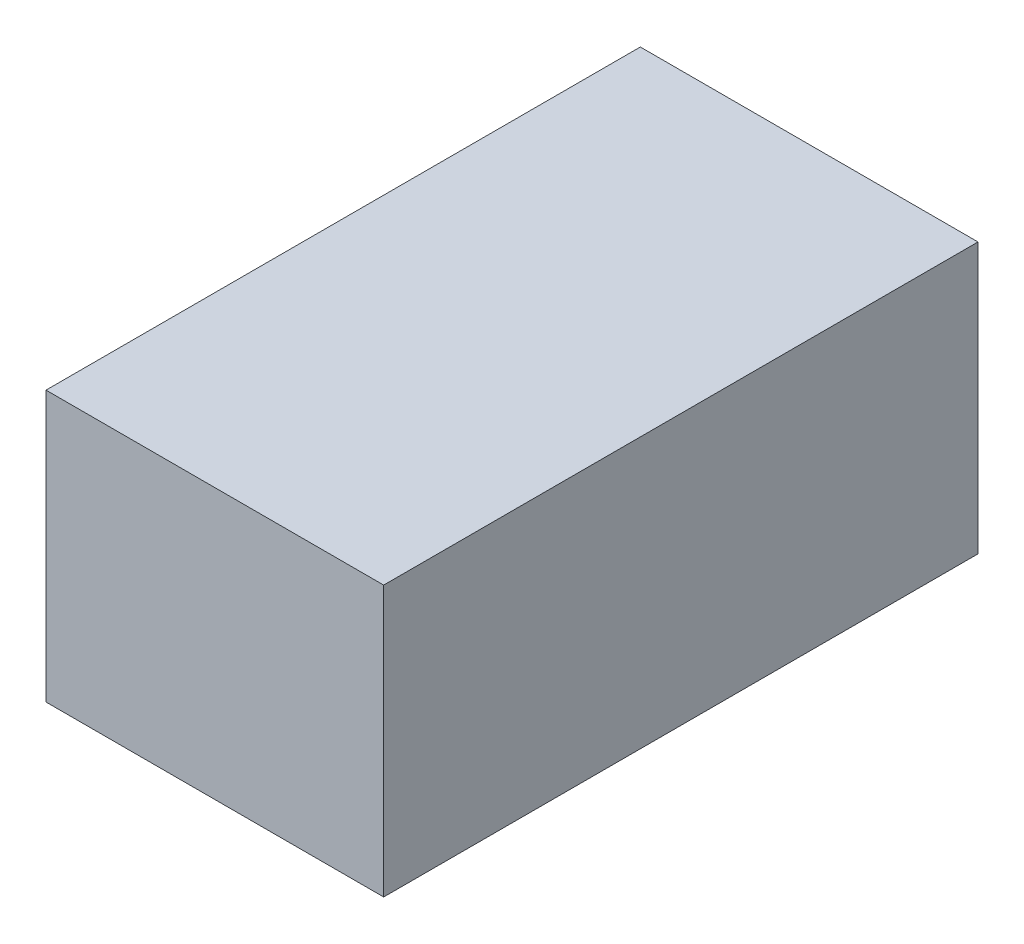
from build123d import *

# Parameters (mm, degrees)
ESQUISSE1_W        = 1.25
ESQUISSE1_H        = 2.2
BOSS_EXTRU_1_DEPTH = 1


with BuildPart() as part:
    # Esquisse1 → Boss.-Extru.1 (new body)
    with BuildSketch(Plane(origin=(0, 0, 0), x_dir=(1, 0, 0), z_dir=(0, 1, 0))):
        Rectangle(ESQUISSE1_W, ESQUISSE1_H)
    extrude(amount=BOSS_EXTRU_1_DEPTH)


solid = part.part
